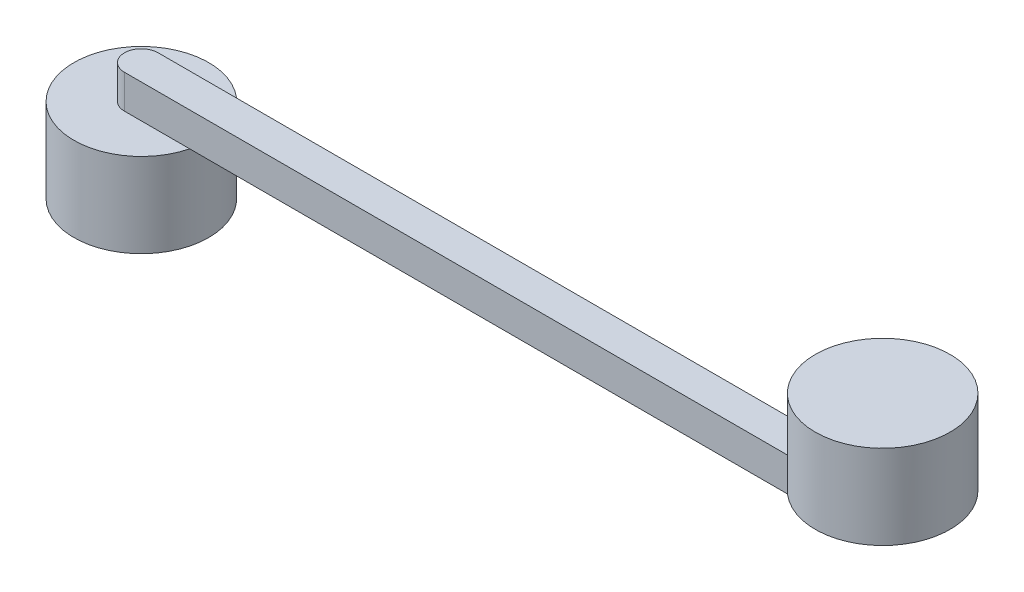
ISO-10303-21;
HEADER;
FILE_DESCRIPTION(('STEP AP214'),'2;1');
FILE_NAME('part.step','',(''),(''),'','','');
FILE_SCHEMA(('AUTOMOTIVE_DESIGN { 1 0 10303 214 1 1 1 1 }'));
ENDSEC;
DATA;
#1=APPLICATION_CONTEXT('core data for automotive mechanical design processes');
#2=APPLICATION_PROTOCOL_DEFINITION('international standard','automotive_design',2000,#1);
#3=PRODUCT_CONTEXT('',#1,'mechanical');
#4=PRODUCT('Part','Part','',(#3));
#5=PRODUCT_RELATED_PRODUCT_CATEGORY('part','',(#4));
#6=PRODUCT_DEFINITION_FORMATION('','',#4);
#7=PRODUCT_DEFINITION_CONTEXT('part definition',#1,'design');
#8=PRODUCT_DEFINITION('design','',#6,#7);
#9=PRODUCT_DEFINITION_SHAPE('','',#8);
#10=(LENGTH_UNIT() NAMED_UNIT(*) SI_UNIT(.MILLI.,.METRE.));
#11=(NAMED_UNIT(*) PLANE_ANGLE_UNIT() SI_UNIT($,.RADIAN.));
#12=(NAMED_UNIT(*) SI_UNIT($,.STERADIAN.) SOLID_ANGLE_UNIT());
#13=UNCERTAINTY_MEASURE_WITH_UNIT(LENGTH_MEASURE(1.E-05),#10,'distance_accuracy_value','');
#14=(GEOMETRIC_REPRESENTATION_CONTEXT(3) GLOBAL_UNCERTAINTY_ASSIGNED_CONTEXT((#13)) GLOBAL_UNIT_ASSIGNED_CONTEXT((#10,
#11,#12)) REPRESENTATION_CONTEXT('',''));
#15=CARTESIAN_POINT('',(0.,0.,0.));
#16=DIRECTION('',(0.,0.,1.));
#17=DIRECTION('',(1.,0.,0.));
#18=AXIS2_PLACEMENT_3D('',#15,#16,#17);
#19=CARTESIAN_POINT('',(-139.7,12.7,0.));
#20=DIRECTION('',(0.,-1.,0.));
#21=DIRECTION('',(0.,0.,-1.));
#22=AXIS2_PLACEMENT_3D('',#19,#20,#21);
#23=PLANE('',#22);
#24=CARTESIAN_POINT('',(139.7,12.7,0.));
#25=DIRECTION('',(0.,1.,0.));
#26=DIRECTION('',(0.,0.,1.));
#27=AXIS2_PLACEMENT_3D('',#24,#25,#26);
#28=CIRCLE('',#27,25.4);
#29=CARTESIAN_POINT('',(115.106555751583,12.7,-6.35));
#30=VERTEX_POINT('',#29);
#31=CARTESIAN_POINT('',(115.106555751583,12.7,6.35));
#32=VERTEX_POINT('',#31);
#33=EDGE_CURVE('E54',#30,#32,#28,.T.);
#34=ORIENTED_EDGE('',*,*,#33,.F.);
#35=DIRECTION('',(-1.,0.,0.));
#36=VECTOR('',#35,1.);
#37=CARTESIAN_POINT('',(-139.7,12.7,-6.35));
#38=LINE('',#37,#36);
#39=CARTESIAN_POINT('',(-139.7,12.7,-6.35));
#40=VERTEX_POINT('',#39);
#41=EDGE_CURVE('E125',#30,#40,#38,.T.);
#42=ORIENTED_EDGE('',*,*,#41,.T.);
#43=CARTESIAN_POINT('',(-139.7,12.7,0.));
#44=DIRECTION('',(0.,1.,0.));
#45=DIRECTION('',(0.,0.,-1.));
#46=AXIS2_PLACEMENT_3D('',#43,#44,#45);
#47=CIRCLE('',#46,6.35);
#48=CARTESIAN_POINT('',(-139.7,12.7,6.35));
#49=VERTEX_POINT('',#48);
#50=EDGE_CURVE('E115',#40,#49,#47,.T.);
#51=ORIENTED_EDGE('',*,*,#50,.T.);
#52=DIRECTION('',(1.,0.,0.));
#53=VECTOR('',#52,1.);
#54=CARTESIAN_POINT('',(139.7,12.7,6.35));
#55=LINE('',#54,#53);
#56=EDGE_CURVE('E120',#49,#32,#55,.T.);
#57=ORIENTED_EDGE('',*,*,#56,.T.);
#58=EDGE_LOOP('',(#34,#42,#51,#57));
#59=FACE_BOUND('',#58,.T.);
#60=ADVANCED_FACE('F31',(#59),#23,.F.);
#61=CARTESIAN_POINT('',(-139.7,12.7,0.));
#62=DIRECTION('',(0.,-1.,0.));
#63=DIRECTION('',(0.,0.,-1.));
#64=AXIS2_PLACEMENT_3D('',#61,#62,#63);
#65=CYLINDRICAL_SURFACE('',#64,6.35);
#66=CARTESIAN_POINT('',(-139.7,0.,0.));
#67=DIRECTION('',(0.,1.,0.));
#68=DIRECTION('',(0.,0.,-1.));
#69=AXIS2_PLACEMENT_3D('',#66,#67,#68);
#70=CIRCLE('',#69,6.35);
#71=CARTESIAN_POINT('',(-139.7,0.,-6.35));
#72=VERTEX_POINT('',#71);
#73=CARTESIAN_POINT('',(-139.7,0.,6.35));
#74=VERTEX_POINT('',#73);
#75=EDGE_CURVE('E97',#72,#74,#70,.T.);
#76=ORIENTED_EDGE('',*,*,#75,.T.);
#77=DIRECTION('',(0.,-1.,0.));
#78=VECTOR('',#77,1.);
#79=CARTESIAN_POINT('',(-139.7,12.7,6.35));
#80=LINE('',#79,#78);
#81=EDGE_CURVE('E11',#49,#74,#80,.T.);
#82=ORIENTED_EDGE('',*,*,#81,.F.);
#83=ORIENTED_EDGE('',*,*,#50,.F.);
#84=DIRECTION('',(0.,-1.,0.));
#85=VECTOR('',#84,1.);
#86=CARTESIAN_POINT('',(-139.7,12.7,-6.35));
#87=LINE('',#86,#85);
#88=EDGE_CURVE('E129',#40,#72,#87,.T.);
#89=ORIENTED_EDGE('',*,*,#88,.T.);
#90=EDGE_LOOP('',(#76,#82,#83,#89));
#91=FACE_BOUND('',#90,.T.);
#92=ADVANCED_FACE('F33',(#91),#65,.T.);
#93=CARTESIAN_POINT('',(139.7,12.7,6.35));
#94=DIRECTION('',(0.,0.,-1.));
#95=DIRECTION('',(-1.,0.,0.));
#96=AXIS2_PLACEMENT_3D('',#93,#94,#95);
#97=PLANE('',#96);
#98=DIRECTION('',(1.,0.,0.));
#99=VECTOR('',#98,1.);
#100=CARTESIAN_POINT('',(139.7,0.,6.35));
#101=LINE('',#100,#99);
#102=CARTESIAN_POINT('',(-115.106555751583,0.,6.35));
#103=VERTEX_POINT('',#102);
#104=EDGE_CURVE('E84',#74,#103,#101,.T.);
#105=ORIENTED_EDGE('',*,*,#104,.T.);
#106=CARTESIAN_POINT('',(139.7,0.,6.35));
#107=VERTEX_POINT('',#106);
#108=EDGE_CURVE('E86',#103,#107,#101,.T.);
#109=ORIENTED_EDGE('',*,*,#108,.T.);
#110=DIRECTION('',(0.,-1.,0.));
#111=VECTOR('',#110,1.);
#112=CARTESIAN_POINT('',(139.7,12.7,6.35));
#113=LINE('',#112,#111);
#114=CARTESIAN_POINT('',(139.7,12.7,6.35));
#115=VERTEX_POINT('',#114);
#116=EDGE_CURVE('E39',#115,#107,#113,.T.);
#117=ORIENTED_EDGE('',*,*,#116,.F.);
#118=EDGE_CURVE('E118',#32,#115,#55,.T.);
#119=ORIENTED_EDGE('',*,*,#118,.F.);
#120=ORIENTED_EDGE('',*,*,#56,.F.);
#121=ORIENTED_EDGE('',*,*,#81,.T.);
#122=EDGE_LOOP('',(#105,#109,#117,#119,#120,#121));
#123=FACE_BOUND('',#122,.T.);
#124=ADVANCED_FACE('F85',(#123),#97,.F.);
#125=CARTESIAN_POINT('',(139.7,12.7,0.));
#126=DIRECTION('',(0.,-1.,0.));
#127=DIRECTION('',(0.,0.,-1.));
#128=AXIS2_PLACEMENT_3D('',#125,#126,#127);
#129=CYLINDRICAL_SURFACE('',#128,6.35);
#130=CARTESIAN_POINT('',(139.7,0.,0.));
#131=DIRECTION('',(0.,1.,0.));
#132=DIRECTION('',(0.,0.,-1.));
#133=AXIS2_PLACEMENT_3D('',#130,#131,#132);
#134=CIRCLE('',#133,6.35);
#135=CARTESIAN_POINT('',(139.7,0.,-6.35));
#136=VERTEX_POINT('',#135);
#137=EDGE_CURVE('E93',#107,#136,#134,.T.);
#138=ORIENTED_EDGE('',*,*,#137,.T.);
#139=DIRECTION('',(0.,-1.,0.));
#140=VECTOR('',#139,1.);
#141=CARTESIAN_POINT('',(139.7,12.7,-6.35));
#142=LINE('',#141,#140);
#143=CARTESIAN_POINT('',(139.7,12.7,-6.35));
#144=VERTEX_POINT('',#143);
#145=EDGE_CURVE('E135',#144,#136,#142,.T.);
#146=ORIENTED_EDGE('',*,*,#145,.F.);
#147=CARTESIAN_POINT('',(139.7,12.7,0.));
#148=DIRECTION('',(0.,1.,0.));
#149=DIRECTION('',(0.,0.,-1.));
#150=AXIS2_PLACEMENT_3D('',#147,#148,#149);
#151=CIRCLE('',#150,6.35);
#152=EDGE_CURVE('E122',#115,#144,#151,.T.);
#153=ORIENTED_EDGE('',*,*,#152,.F.);
#154=ORIENTED_EDGE('',*,*,#116,.T.);
#155=EDGE_LOOP('',(#138,#146,#153,#154));
#156=FACE_BOUND('',#155,.T.);
#157=ADVANCED_FACE('F139',(#156),#129,.T.);
#158=CARTESIAN_POINT('',(-139.7,12.7,-6.35));
#159=DIRECTION('',(0.,0.,1.));
#160=DIRECTION('',(1.,0.,0.));
#161=AXIS2_PLACEMENT_3D('',#158,#159,#160);
#162=PLANE('',#161);
#163=DIRECTION('',(-1.,0.,0.));
#164=VECTOR('',#163,1.);
#165=CARTESIAN_POINT('',(-139.7,0.,-6.35));
#166=LINE('',#165,#164);
#167=CARTESIAN_POINT('',(-115.106555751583,0.,-6.35));
#168=VERTEX_POINT('',#167);
#169=EDGE_CURVE('E119',#136,#168,#166,.T.);
#170=ORIENTED_EDGE('',*,*,#169,.T.);
#171=EDGE_CURVE('E102',#168,#72,#166,.T.);
#172=ORIENTED_EDGE('',*,*,#171,.T.);
#173=ORIENTED_EDGE('',*,*,#88,.F.);
#174=ORIENTED_EDGE('',*,*,#41,.F.);
#175=EDGE_CURVE('E126',#144,#30,#38,.T.);
#176=ORIENTED_EDGE('',*,*,#175,.F.);
#177=ORIENTED_EDGE('',*,*,#145,.T.);
#178=EDGE_LOOP('',(#170,#172,#173,#174,#176,#177));
#179=FACE_BOUND('',#178,.T.);
#180=ADVANCED_FACE('F170',(#179),#162,.F.);
#181=CARTESIAN_POINT('',(-139.7,0.,0.));
#182=DIRECTION('',(0.,-1.,0.));
#183=DIRECTION('',(0.,0.,-1.));
#184=AXIS2_PLACEMENT_3D('',#181,#182,#183);
#185=PLANE('',#184);
#186=CARTESIAN_POINT('',(-139.7,0.,0.));
#187=DIRECTION('',(0.,-1.,0.));
#188=DIRECTION('',(0.,0.,-1.));
#189=AXIS2_PLACEMENT_3D('',#186,#187,#188);
#190=CIRCLE('',#189,25.4);
#191=EDGE_CURVE('E46',#168,#103,#190,.T.);
#192=ORIENTED_EDGE('',*,*,#191,.F.);
#193=ORIENTED_EDGE('',*,*,#169,.F.);
#194=ORIENTED_EDGE('',*,*,#137,.F.);
#195=ORIENTED_EDGE('',*,*,#108,.F.);
#196=EDGE_LOOP('',(#192,#193,#194,#195));
#197=FACE_BOUND('',#196,.T.);
#198=ADVANCED_FACE('F96',(#197),#185,.T.);
#199=CARTESIAN_POINT('',(139.7,12.7,0.));
#200=DIRECTION('',(0.,1.,0.));
#201=DIRECTION('',(0.,0.,1.));
#202=AXIS2_PLACEMENT_3D('',#199,#200,#201);
#203=PLANE('',#202);
#204=EDGE_CURVE('E108',#32,#30,#28,.T.);
#205=ORIENTED_EDGE('',*,*,#204,.F.);
#206=ORIENTED_EDGE('',*,*,#118,.T.);
#207=ORIENTED_EDGE('',*,*,#152,.T.);
#208=ORIENTED_EDGE('',*,*,#175,.T.);
#209=EDGE_LOOP('',(#205,#206,#207,#208));
#210=FACE_BOUND('',#209,.T.);
#211=ADVANCED_FACE('F145',(#210),#203,.F.);
#212=CARTESIAN_POINT('',(139.7,44.45,0.));
#213=DIRECTION('',(0.,-1.,0.));
#214=DIRECTION('',(0.,0.,-1.));
#215=AXIS2_PLACEMENT_3D('',#212,#213,#214);
#216=CYLINDRICAL_SURFACE('',#215,25.4);
#217=CARTESIAN_POINT('',(139.7,44.45,0.));
#218=DIRECTION('',(0.,1.,0.));
#219=DIRECTION('',(0.,0.,1.));
#220=AXIS2_PLACEMENT_3D('',#217,#218,#219);
#221=CIRCLE('',#220,25.4);
#222=CARTESIAN_POINT('',(139.7,44.45,25.4));
#223=VERTEX_POINT('',#222);
#224=EDGE_CURVE('E111',#223,#223,#221,.T.);
#225=ORIENTED_EDGE('',*,*,#224,.F.);
#226=EDGE_LOOP('',(#225));
#227=FACE_BOUND('',#226,.T.);
#228=ORIENTED_EDGE('',*,*,#33,.T.);
#229=ORIENTED_EDGE('',*,*,#204,.T.);
#230=EDGE_LOOP('',(#228,#229));
#231=FACE_BOUND('',#230,.T.);
#232=ADVANCED_FACE('F148',(#227,#231),#216,.T.);
#233=CARTESIAN_POINT('',(139.7,44.45,0.));
#234=DIRECTION('',(0.,1.,0.));
#235=DIRECTION('',(0.,0.,1.));
#236=AXIS2_PLACEMENT_3D('',#233,#234,#235);
#237=PLANE('',#236);
#238=ORIENTED_EDGE('',*,*,#224,.T.);
#239=EDGE_LOOP('',(#238));
#240=FACE_BOUND('',#239,.T.);
#241=ADVANCED_FACE('F150',(#240),#237,.T.);
#242=CARTESIAN_POINT('',(-139.7,-31.75,0.));
#243=DIRECTION('',(0.,1.,0.));
#244=DIRECTION('',(0.,0.,1.));
#245=AXIS2_PLACEMENT_3D('',#242,#243,#244);
#246=CYLINDRICAL_SURFACE('',#245,25.4);
#247=CARTESIAN_POINT('',(-139.7,-31.75,0.));
#248=DIRECTION('',(0.,-1.,0.));
#249=DIRECTION('',(0.,0.,-1.));
#250=AXIS2_PLACEMENT_3D('',#247,#248,#249);
#251=CIRCLE('',#250,25.4);
#252=CARTESIAN_POINT('',(-139.7,-31.75,-25.4));
#253=VERTEX_POINT('',#252);
#254=EDGE_CURVE('E106',#253,#253,#251,.T.);
#255=ORIENTED_EDGE('',*,*,#254,.F.);
#256=EDGE_LOOP('',(#255));
#257=FACE_BOUND('',#256,.T.);
#258=ORIENTED_EDGE('',*,*,#191,.T.);
#259=EDGE_CURVE('E100',#103,#168,#190,.T.);
#260=ORIENTED_EDGE('',*,*,#259,.T.);
#261=EDGE_LOOP('',(#258,#260));
#262=FACE_BOUND('',#261,.T.);
#263=ADVANCED_FACE('F105',(#257,#262),#246,.T.);
#264=CARTESIAN_POINT('',(-139.7,-31.75,0.));
#265=DIRECTION('',(0.,-1.,0.));
#266=DIRECTION('',(0.,0.,-1.));
#267=AXIS2_PLACEMENT_3D('',#264,#265,#266);
#268=PLANE('',#267);
#269=ORIENTED_EDGE('',*,*,#254,.T.);
#270=EDGE_LOOP('',(#269));
#271=FACE_BOUND('',#270,.T.);
#272=ADVANCED_FACE('F231',(#271),#268,.T.);
#273=CARTESIAN_POINT('',(-139.7,0.,0.));
#274=DIRECTION('',(0.,-1.,0.));
#275=DIRECTION('',(0.,0.,-1.));
#276=AXIS2_PLACEMENT_3D('',#273,#274,#275);
#277=PLANE('',#276);
#278=ORIENTED_EDGE('',*,*,#171,.F.);
#279=ORIENTED_EDGE('',*,*,#259,.F.);
#280=ORIENTED_EDGE('',*,*,#104,.F.);
#281=ORIENTED_EDGE('',*,*,#75,.F.);
#282=EDGE_LOOP('',(#278,#279,#280,#281));
#283=FACE_BOUND('',#282,.T.);
#284=ADVANCED_FACE('F101',(#283),#277,.F.);
#285=CLOSED_SHELL('',(#60,#92,#124,#157,#180,#198,#211,#232,#241,#263,#272,#284));
#286=MANIFOLD_SOLID_BREP('B2',#285);
#287=ADVANCED_BREP_SHAPE_REPRESENTATION('',(#18,#286),#14);
#288=SHAPE_DEFINITION_REPRESENTATION(#9,#287);
ENDSEC;
END-ISO-10303-21;
